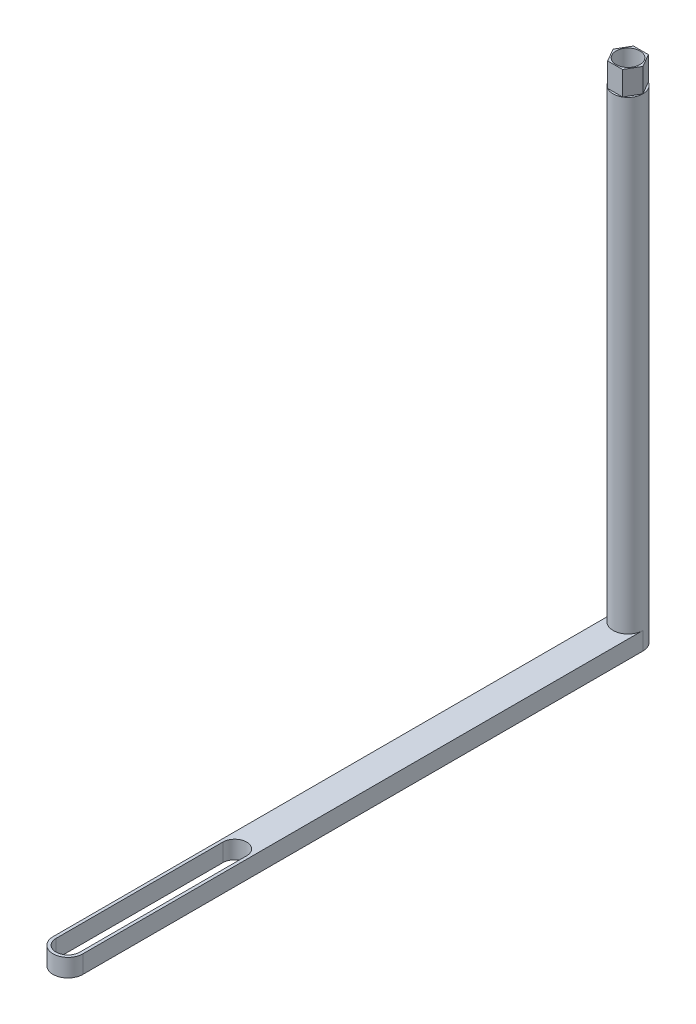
from build123d import *

# Parameters (mm, degrees)
SKETCH1_R           = 1.25
SKETCH1_R_2         = 1
BOSS_EXTRUDE1_DEPTH = 42.5
SKETCH2_R           = 1
BOSS_EXTRUDE2_DEPTH = 1.5
CUT_EXTRUDE1_START  = -2
CUT_EXTRUDE1_DEPTH  = 2


with BuildPart() as part:
    # Sketch1 → Boss-Extrude1 (new body)
    with BuildSketch(Plane(origin=(0, 0, 0), x_dir=(1, 0, 0), z_dir=(0, 1, 0))):
        with Locations(Location((0, 0, 0), (0, 0, 270))):
            Circle(SKETCH1_R)
        with Locations(Location((0, 0, 0), (0, 0, 270))):
            Circle(SKETCH1_R_2, mode=Mode.SUBTRACT)
    extrude(amount=BOSS_EXTRUDE1_DEPTH)

    # Sketch2 → Boss-Extrude2 (add)
    with BuildSketch(Plane.XZ):
        with BuildLine():
            Line((-1.25, 0), (-1.25, 47))
            ThreePointArc((-1.25, 47), (0, 48.25), (1.25, 47))
            Line((1.25, 47), (1.25, 0))
            ThreePointArc((1.25, 0), (0, -1.25), (-1.25, 0))
        make_face()
        with Locations(Location((0, 0, 0), (0, 0, 90))):
            Circle(SKETCH2_R, mode=Mode.SUBTRACT)
        with BuildLine():
            Line((1, 47), (1, 33))
            ThreePointArc((1, 33), (0, 32), (-1, 33))
            Line((-1, 33), (-1, 47))
            ThreePointArc((-1, 47), (0, 48), (1, 47))
        make_face(mode=Mode.SUBTRACT)
    extrude(amount=-BOSS_EXTRUDE2_DEPTH)

    # Sketch3 → Cut-Extrude1 (cut)
    with BuildSketch(Plane(origin=(0, 42.5, 0), x_dir=(1, 0, 0), z_dir=(0, 1, 0)).offset(CUT_EXTRUDE1_START)):
        with BuildLine():
            ThreePointArc((-1.25, 0), (-1.082531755, -0.625), (-0.625, -1.082531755))
            Line((-0.625, -1.082531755), (-1.25, 0))
        make_face()
        with BuildLine():
            Line((-1.25, 0), (-0.625, 1.082531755))
            ThreePointArc((-0.625, 1.082531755), (-1.082531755, 0.625), (-1.25, 0))
        make_face()
        with BuildLine():
            Line((-0.625, 1.082531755), (0.625, 1.082531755))
            ThreePointArc((0.625, 1.082531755), (0, 1.25), (-0.625, 1.082531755))
        make_face()
        with BuildLine():
            Line((0.625, 1.082531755), (1.25, 0))
            ThreePointArc((1.25, 0), (1.082531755, 0.625), (0.625, 1.082531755))
        make_face()
        with BuildLine():
            ThreePointArc((0.625, -1.082531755), (1.082531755, -0.625), (1.25, 0))
            Line((1.25, 0), (0.625, -1.082531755))
        make_face()
        with BuildLine():
            ThreePointArc((-0.625, -1.082531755), (0, -1.25), (0.625, -1.082531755))
            Line((0.625, -1.082531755), (-0.625, -1.082531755))
        make_face()
    extrude(amount=CUT_EXTRUDE1_DEPTH, mode=Mode.SUBTRACT)


solid = part.part
